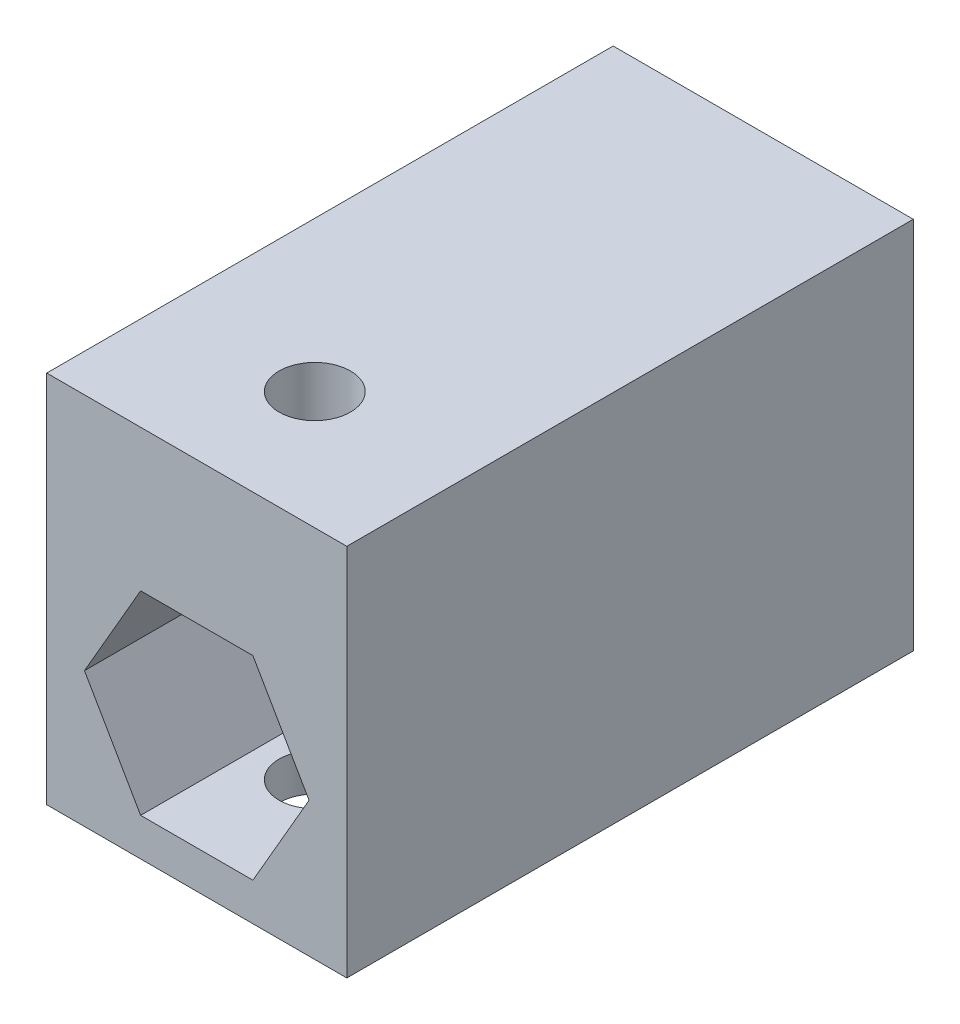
from build123d import *

# Parameters (mm, degrees)
SKETCH1_W                   = 20.184637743
SKETCH1_H                   = 25.146
BOSS_EXTRUDE1_DEPTH         = 28.575
F_12_0_189_DIAMETER_HOLE1_D = 4.8006
SKETCH4_W                   = 20.184637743
SKETCH4_H                   = 25.146
SKETCH4_R                   = 2.413
BOSS_EXTRUDE2_DEPTH         = 9.525


with BuildPart() as part:
    # Sketch1 → Boss-Extrude1 (new body)
    with BuildSketch(Plane.XY):
        with Locations((10.092318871, 12.573)):
            Rectangle(SKETCH1_W, SKETCH1_H)
        Polygon((13.868478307, 15.621), (6.316159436, 15.621), (2.54, 9.0805), (6.316159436, 2.54), (13.868478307, 2.54), (17.644637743, 9.0805), align=None, mode=Mode.SUBTRACT)
    extrude(amount=BOSS_EXTRUDE1_DEPTH)

    # 12 _0.189_ Diameter Hole1 (through all)
    with Locations(Plane(origin=(0, 25.146, 0), x_dir=(1, 0, 0), z_dir=(0, 1, 0))):
        with Locations((10.092318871, -20.6375)):
            Hole(F_12_0_189_DIAMETER_HOLE1_D / 2)

    # Sketch4 → Boss-Extrude2 (add)
    with BuildSketch(Plane(origin=(0, 0, 0), x_dir=(-1, 0, 0), z_dir=(0, 0, -1))):
        with Locations((-10.092318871, 12.573)):
            Rectangle(SKETCH4_W, SKETCH4_H)
        with Locations(Location((-10.092318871, 9.0805, 0), (0, 0, 180))):
            Circle(SKETCH4_R, mode=Mode.SUBTRACT)
    extrude(amount=BOSS_EXTRUDE2_DEPTH)


solid = part.part
